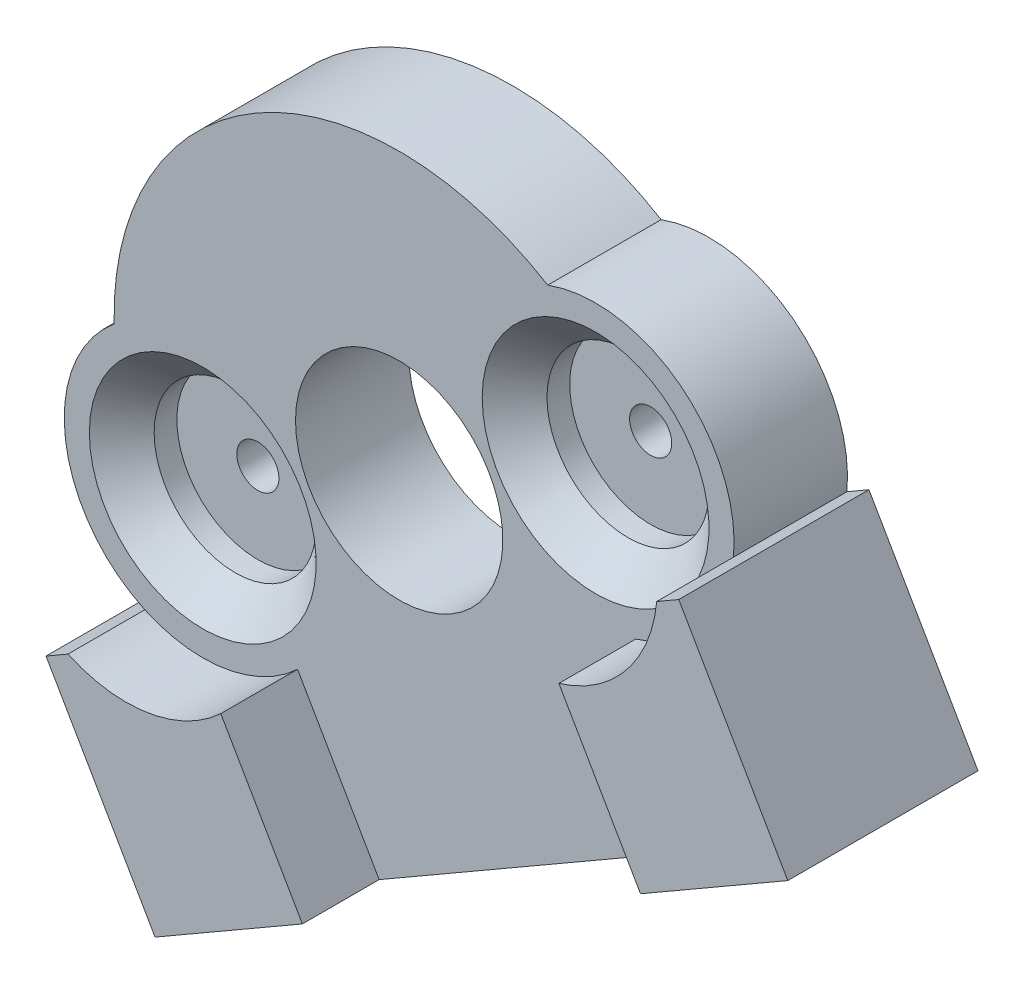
from build123d import *

# Parameters (mm, degrees)
ESQUISSE1_R             = 3.2
ESQUISSE1_R_2           = 0.65
EXTRUSION1_DEPTH        = 5.87
ESQUISSE2_R             = 0.65
EXTRUSION2_DEPTH        = 1
ENL_V_START             = -2.37
ESQUISSE3_R             = 0.65
ESQUISSE3_R_2           = 3.2
ENL_V_MAT_EXTRU_4_DEPTH = 2.37
ESQUISSE4_R             = 2.5
ENL_V_MAT_EXTRU_5_DEPTH = 1.7
CHANFREIN1_SIZE         = 1
ESQUISSE7_R             = 1.2
ESQUISSE7_R_2           = 1.186275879
ESQUISSE7_R_3           = 0.65
ENL_V_MAT_EXTRU_6_DEPTH = 3


with BuildPart() as part:
    # Esquisse1 → Extrusion1 (new body)
    with BuildSketch(Plane.XY):
        with BuildLine():
            Line((14.364436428, -2.329933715), (-5.164436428, -13.604933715))
            Line((-5.164436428, -13.604933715), (-8.530350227, -7.775))
            Line((-8.530350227, -7.775), (-7.850973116, -7.382761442))
            ThreePointArc((-7.850973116, -7.382761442), (-10.300397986, -4.059566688), (-8.797384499, -0.214536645))
            ThreePointArc((-8.797384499, -0.214536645), (-4.4, 7.621023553), (4.584486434, 7.511490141))
            ThreePointArc((4.584486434, 7.511490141), (8.665886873, 6.890622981), (10.319145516, 3.107761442))
            Line((10.319145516, 3.107761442), (10.998522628, 3.5))
            Line((10.998522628, 3.5), (14.364436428, -2.329933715))
        make_face()
        Circle(ESQUISSE1_R, mode=Mode.SUBTRACT)
        with Locations((6.062177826, 3.5)):
            Circle(ESQUISSE1_R_2, mode=Mode.SUBTRACT)
        with Locations((-6.062177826, -3.5)):
            Circle(ESQUISSE1_R_2, mode=Mode.SUBTRACT)
    extrude(amount=EXTRUSION1_DEPTH)

    # Esquisse2 → Extrusion2 (add)
    with BuildSketch(Plane(origin=(0, 0, 0), x_dir=(-1, 0, 0), z_dir=(0, 0, -1))):
        with Locations((0, 7)):
            Circle(ESQUISSE2_R)
        with Locations((0, -7)):
            Circle(ESQUISSE2_R)
    extrude(amount=EXTRUSION2_DEPTH)

    # Esquisse3 → Enl_v. mat.-Extru.4 (cut)
    with BuildSketch(Plane.XY.offset(5.87).offset(ENL_V_START)):
        with BuildLine():
            ThreePointArc((-7.850973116, -7.382761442), (-5.376922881, -7.719721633), (-3.136637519, -6.617184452))
            Line((-3.136637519, -6.617184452), (-0.617803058, -10.979933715))
            Line((-0.617803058, -10.979933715), (9.817803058, -4.954933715))
            Line((9.817803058, -4.954933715), (7.298968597, -0.592184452))
            ThreePointArc((7.298968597, -0.592184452), (9.373936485, 0.796690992), (10.319145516, 3.107761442))
            ThreePointArc((10.319145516, 3.107761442), (8.665886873, 6.890622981), (4.584486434, 7.511490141))
            ThreePointArc((4.584486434, 7.511490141), (-4.4, 7.621023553), (-8.797384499, -0.214536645))
            ThreePointArc((-8.797384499, -0.214536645), (-10.300397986, -4.059566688), (-7.850973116, -7.382761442))
        make_face()
        with Locations(Location((-6.062177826, -3.5, 0), (0, 0, 180))):
            Circle(ESQUISSE3_R, mode=Mode.SUBTRACT)
        with Locations(Location((0, 0, 0), (0, 0, 180))):
            Circle(ESQUISSE3_R_2, mode=Mode.SUBTRACT)
        with Locations(Location((6.062177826, 3.5, 0), (0, 0, 180))):
            Circle(ESQUISSE3_R, mode=Mode.SUBTRACT)
    extrude(amount=ENL_V_MAT_EXTRU_4_DEPTH, mode=Mode.SUBTRACT)

    # Esquisse4 → Enl_v. mat.-Extru.5 (cut)
    with BuildSketch(Plane.XY.offset(3.5)):
        with Locations((6.062177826, 3.5)):
            Circle(ESQUISSE4_R)
        with Locations((-6.062177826, -3.5)):
            Circle(ESQUISSE4_R)
    extrude(amount=-ENL_V_MAT_EXTRU_5_DEPTH, mode=Mode.SUBTRACT)

    # Chanfrein1
    chanfrein1_edges = [part.edges().sort_by_distance(p)[0] for p in [
        (3.562177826, 3.5, 3.5),
        (-8.562177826, -3.5, 3.5),
    ]]
    chamfer(chanfrein1_edges, length=CHANFREIN1_SIZE)

    # Esquisse7 → Enl_v. mat.-Extru.6 (cut)
    with BuildSketch(Plane(origin=(4.6, -7.967433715, 0), x_dir=(0.8660254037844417, 0.4999999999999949, 0), z_dir=(0.4999999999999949, -0.8660254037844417, 0))):
        with Locations((-8.496271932, 2.536894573)):
            Circle(ESQUISSE7_R)
        with Locations((8.903728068, 2.536894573)):
            Circle(ESQUISSE7_R_2)
        with Locations((5.203728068, 1.072404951)):
            Circle(ESQUISSE7_R_3)
        with Locations((-4.796271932, 1.072404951)):
            Circle(ESQUISSE7_R_3)
    extrude(amount=-ENL_V_MAT_EXTRU_6_DEPTH, mode=Mode.SUBTRACT)


solid = part.part
